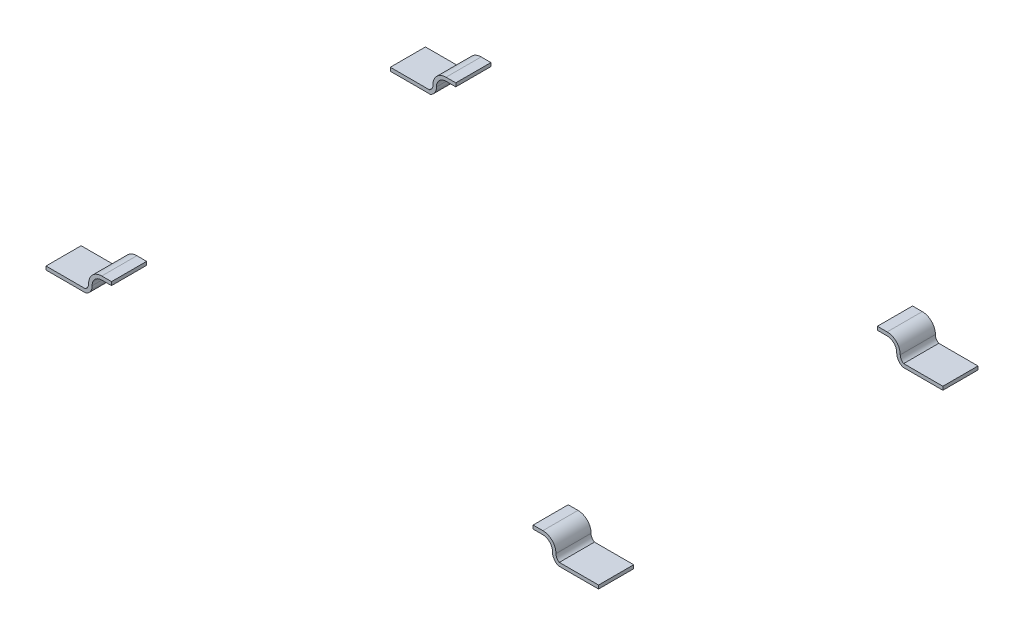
ISO-10303-21;
HEADER;
FILE_DESCRIPTION(('STEP AP214'),'2;1');
FILE_NAME('part.step','',(''),(''),'','','');
FILE_SCHEMA(('AUTOMOTIVE_DESIGN { 1 0 10303 214 1 1 1 1 }'));
ENDSEC;
DATA;
#1=APPLICATION_CONTEXT('core data for automotive mechanical design processes');
#2=APPLICATION_PROTOCOL_DEFINITION('international standard','automotive_design',2000,#1);
#3=PRODUCT_CONTEXT('',#1,'mechanical');
#4=PRODUCT('Part','Part','',(#3));
#5=PRODUCT_RELATED_PRODUCT_CATEGORY('part','',(#4));
#6=PRODUCT_DEFINITION_FORMATION('','',#4);
#7=PRODUCT_DEFINITION_CONTEXT('part definition',#1,'design');
#8=PRODUCT_DEFINITION('design','',#6,#7);
#9=PRODUCT_DEFINITION_SHAPE('','',#8);
#10=(LENGTH_UNIT() NAMED_UNIT(*) SI_UNIT(.MILLI.,.METRE.));
#11=(NAMED_UNIT(*) PLANE_ANGLE_UNIT() SI_UNIT($,.RADIAN.));
#12=(NAMED_UNIT(*) SI_UNIT($,.STERADIAN.) SOLID_ANGLE_UNIT());
#13=UNCERTAINTY_MEASURE_WITH_UNIT(LENGTH_MEASURE(1.E-05),#10,'distance_accuracy_value','');
#14=(GEOMETRIC_REPRESENTATION_CONTEXT(3) GLOBAL_UNCERTAINTY_ASSIGNED_CONTEXT((#13)) GLOBAL_UNIT_ASSIGNED_CONTEXT((#10,
#11,#12)) REPRESENTATION_CONTEXT('',''));
#15=CARTESIAN_POINT('',(0.,0.,0.));
#16=DIRECTION('',(0.,0.,1.));
#17=DIRECTION('',(1.,0.,0.));
#18=AXIS2_PLACEMENT_3D('',#15,#16,#17);
#19=CARTESIAN_POINT('',(-0.941850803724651,0.0497758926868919,0.));
#20=DIRECTION('',(0.,1.,0.));
#21=DIRECTION('',(-1.,0.,0.));
#22=AXIS2_PLACEMENT_3D('',#19,#20,#21);
#23=PLANE('',#22);
#24=DIRECTION('',(1.,0.,0.));
#25=VECTOR('',#24,1.);
#26=CARTESIAN_POINT('',(-0.46748291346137,0.0497758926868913,-0.5));
#27=LINE('',#26,#25);
#28=CARTESIAN_POINT('',(-0.383700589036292,0.0497758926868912,-0.5));
#29=VERTEX_POINT('',#28);
#30=CARTESIAN_POINT('',(-0.941850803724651,0.0497758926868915,-0.5));
#31=VERTEX_POINT('',#30);
#32=EDGE_CURVE('P0_E121',#29,#31,#27,.F.);
#33=ORIENTED_EDGE('',*,*,#32,.T.);
#34=DIRECTION('',(0.,0.,1.));
#35=VECTOR('',#34,1.);
#36=CARTESIAN_POINT('',(-0.941850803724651,0.0497758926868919,0.));
#37=LINE('',#36,#35);
#38=CARTESIAN_POINT('',(-0.941850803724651,0.0497758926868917,0.));
#39=VERTEX_POINT('',#38);
#40=EDGE_CURVE('P0_E100',#39,#31,#37,.F.);
#41=ORIENTED_EDGE('',*,*,#40,.F.);
#42=DIRECTION('',(1.,0.,0.));
#43=VECTOR('',#42,1.);
#44=CARTESIAN_POINT('',(-0.46748291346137,0.0497758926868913,0.));
#45=LINE('',#44,#43);
#46=CARTESIAN_POINT('',(-0.383700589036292,0.0497758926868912,0.));
#47=VERTEX_POINT('',#46);
#48=EDGE_CURVE('P0_E98',#47,#39,#45,.F.);
#49=ORIENTED_EDGE('',*,*,#48,.F.);
#50=DIRECTION('',(0.,0.,-1.));
#51=VECTOR('',#50,1.);
#52=CARTESIAN_POINT('',(-0.383700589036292,0.049775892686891,0.));
#53=LINE('',#52,#51);
#54=EDGE_CURVE('P0_E84',#47,#29,#53,.T.);
#55=ORIENTED_EDGE('',*,*,#54,.T.);
#56=EDGE_LOOP('',(#33,#41,#49,#55));
#57=FACE_BOUND('',#56,.T.);
#58=ADVANCED_FACE('P0_F16',(#57),#23,.T.);
#59=CARTESIAN_POINT('',(-0.0100000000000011,0.273237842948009,0.));
#60=DIRECTION('',(0.,-1.,0.));
#61=DIRECTION('',(0.,0.,-1.));
#62=AXIS2_PLACEMENT_3D('',#59,#60,#61);
#63=PLANE('',#62);
#64=DIRECTION('',(1.,0.,0.));
#65=VECTOR('',#64,1.);
#66=CARTESIAN_POINT('',(-0.46748291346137,0.273237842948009,-0.5));
#67=LINE('',#66,#65);
#68=CARTESIAN_POINT('',(-0.148885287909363,0.273237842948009,-0.5));
#69=VERTEX_POINT('',#68);
#70=CARTESIAN_POINT('',(-0.0100000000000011,0.273237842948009,-0.5));
#71=VERTEX_POINT('',#70);
#72=EDGE_CURVE('P0_E143',#69,#71,#67,.T.);
#73=ORIENTED_EDGE('',*,*,#72,.T.);
#74=DIRECTION('',(0.,0.,-1.));
#75=VECTOR('',#74,1.);
#76=CARTESIAN_POINT('',(-0.0100000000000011,0.273237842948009,0.));
#77=LINE('',#76,#75);
#78=CARTESIAN_POINT('',(-0.0100000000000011,0.273237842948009,0.));
#79=VERTEX_POINT('',#78);
#80=EDGE_CURVE('P0_E194',#79,#71,#77,.T.);
#81=ORIENTED_EDGE('',*,*,#80,.F.);
#82=DIRECTION('',(1.,0.,0.));
#83=VECTOR('',#82,1.);
#84=CARTESIAN_POINT('',(-0.46748291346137,0.273237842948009,0.));
#85=LINE('',#84,#83);
#86=CARTESIAN_POINT('',(-0.148885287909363,0.273237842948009,0.));
#87=VERTEX_POINT('',#86);
#88=EDGE_CURVE('P0_E129',#87,#79,#85,.T.);
#89=ORIENTED_EDGE('',*,*,#88,.F.);
#90=DIRECTION('',(0.,0.,-1.));
#91=VECTOR('',#90,1.);
#92=CARTESIAN_POINT('',(-0.148885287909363,0.273237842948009,0.));
#93=LINE('',#92,#91);
#94=EDGE_CURVE('P0_E109',#87,#69,#93,.T.);
#95=ORIENTED_EDGE('',*,*,#94,.T.);
#96=EDGE_LOOP('',(#73,#81,#89,#95));
#97=FACE_BOUND('',#96,.T.);
#98=ADVANCED_FACE('P0_F230',(#97),#63,.T.);
#99=CARTESIAN_POINT('',(-0.0100000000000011,0.323237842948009,0.));
#100=DIRECTION('',(1.,0.,0.));
#101=DIRECTION('',(0.,0.,-1.));
#102=AXIS2_PLACEMENT_3D('',#99,#100,#101);
#103=PLANE('',#102);
#104=DIRECTION('',(0.,1.,0.));
#105=VECTOR('',#104,1.);
#106=CARTESIAN_POINT('',(-0.0100000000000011,0.111450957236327,-0.5));
#107=LINE('',#106,#105);
#108=CARTESIAN_POINT('',(-0.0100000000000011,0.323237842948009,-0.5));
#109=VERTEX_POINT('',#108);
#110=EDGE_CURVE('P0_E158',#71,#109,#107,.T.);
#111=ORIENTED_EDGE('',*,*,#110,.T.);
#112=DIRECTION('',(0.,0.,1.));
#113=VECTOR('',#112,1.);
#114=CARTESIAN_POINT('',(-0.0100000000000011,0.323237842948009,0.));
#115=LINE('',#114,#113);
#116=CARTESIAN_POINT('',(-0.0100000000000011,0.323237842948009,0.));
#117=VERTEX_POINT('',#116);
#118=EDGE_CURVE('P0_E191',#117,#109,#115,.F.);
#119=ORIENTED_EDGE('',*,*,#118,.F.);
#120=DIRECTION('',(0.,1.,0.));
#121=VECTOR('',#120,1.);
#122=CARTESIAN_POINT('',(-0.0100000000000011,0.111450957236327,0.));
#123=LINE('',#122,#121);
#124=EDGE_CURVE('P0_E125',#79,#117,#123,.T.);
#125=ORIENTED_EDGE('',*,*,#124,.F.);
#126=ORIENTED_EDGE('',*,*,#80,.T.);
#127=EDGE_LOOP('',(#111,#119,#125,#126));
#128=FACE_BOUND('',#127,.T.);
#129=ADVANCED_FACE('P0_F205',(#128),#103,.T.);
#130=CARTESIAN_POINT('',(-0.148885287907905,0.323237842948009,0.));
#131=DIRECTION('',(0.,1.,0.));
#132=DIRECTION('',(-1.,0.,0.));
#133=AXIS2_PLACEMENT_3D('',#130,#131,#132);
#134=PLANE('',#133);
#135=DIRECTION('',(1.,0.,0.));
#136=VECTOR('',#135,1.);
#137=CARTESIAN_POINT('',(-0.46748291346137,0.323237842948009,-0.5));
#138=LINE('',#137,#136);
#139=CARTESIAN_POINT('',(-0.148885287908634,0.323237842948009,-0.5));
#140=VERTEX_POINT('',#139);
#141=EDGE_CURVE('P0_E140',#109,#140,#138,.F.);
#142=ORIENTED_EDGE('',*,*,#141,.T.);
#143=DIRECTION('',(0.,0.,-1.));
#144=VECTOR('',#143,1.);
#145=CARTESIAN_POINT('',(-0.148885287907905,0.323237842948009,0.));
#146=LINE('',#145,#144);
#147=CARTESIAN_POINT('',(-0.148885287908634,0.323237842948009,0.));
#148=VERTEX_POINT('',#147);
#149=EDGE_CURVE('P0_E94',#148,#140,#146,.T.);
#150=ORIENTED_EDGE('',*,*,#149,.F.);
#151=DIRECTION('',(1.,0.,0.));
#152=VECTOR('',#151,1.);
#153=CARTESIAN_POINT('',(-0.46748291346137,0.323237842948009,0.));
#154=LINE('',#153,#152);
#155=EDGE_CURVE('P0_E128',#117,#148,#154,.F.);
#156=ORIENTED_EDGE('',*,*,#155,.F.);
#157=ORIENTED_EDGE('',*,*,#118,.T.);
#158=EDGE_LOOP('',(#142,#150,#156,#157));
#159=FACE_BOUND('',#158,.T.);
#160=ADVANCED_FACE('P0_F213',(#159),#134,.T.);
#161=CARTESIAN_POINT('',(-0.148885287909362,0.13687173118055,0.));
#162=DIRECTION('',(0.,0.,-1.));
#163=DIRECTION('',(-1.,0.,0.));
#164=AXIS2_PLACEMENT_3D('',#161,#162,#163);
#165=CYLINDRICAL_SURFACE('',#164,0.186366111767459);
#166=CARTESIAN_POINT('',(-0.148885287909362,0.13687173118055,-0.5));
#167=DIRECTION('',(0.,0.,-1.));
#168=DIRECTION('',(-1.,0.,0.));
#169=AXIS2_PLACEMENT_3D('',#166,#167,#168);
#170=CIRCLE('',#169,0.186366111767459);
#171=CARTESIAN_POINT('',(-0.335225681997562,0.133775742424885,-0.5));
#172=VERTEX_POINT('',#171);
#173=EDGE_CURVE('P0_E138',#140,#172,#170,.F.);
#174=ORIENTED_EDGE('',*,*,#173,.T.);
#175=DIRECTION('',(0.,0.,-1.));
#176=VECTOR('',#175,1.);
#177=CARTESIAN_POINT('',(-0.335225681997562,0.133775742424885,0.));
#178=LINE('',#177,#176);
#179=CARTESIAN_POINT('',(-0.335225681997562,0.133775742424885,0.));
#180=VERTEX_POINT('',#179);
#181=EDGE_CURVE('P0_E79',#172,#180,#178,.F.);
#182=ORIENTED_EDGE('',*,*,#181,.T.);
#183=CARTESIAN_POINT('',(-0.148885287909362,0.13687173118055,0.));
#184=DIRECTION('',(0.,0.,-1.));
#185=DIRECTION('',(-1.,0.,0.));
#186=AXIS2_PLACEMENT_3D('',#183,#184,#185);
#187=CIRCLE('',#186,0.186366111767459);
#188=EDGE_CURVE('P0_E108',#148,#180,#187,.F.);
#189=ORIENTED_EDGE('',*,*,#188,.F.);
#190=ORIENTED_EDGE('',*,*,#149,.T.);
#191=EDGE_LOOP('',(#174,#182,#189,#190));
#192=FACE_BOUND('',#191,.T.);
#193=ADVANCED_FACE('P0_F215',(#192),#165,.T.);
#194=CARTESIAN_POINT('',(-0.429527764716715,0.13220894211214,0.));
#195=DIRECTION('',(0.,0.,-1.));
#196=DIRECTION('',(-1.,0.,0.));
#197=AXIS2_PLACEMENT_3D('',#194,#195,#196);
#198=CYLINDRICAL_SURFACE('',#197,0.0943150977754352);
#199=ORIENTED_EDGE('',*,*,#181,.F.);
#200=CARTESIAN_POINT('',(-0.429527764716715,0.13220894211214,-0.5));
#201=DIRECTION('',(0.,0.,-1.));
#202=DIRECTION('',(-1.,0.,0.));
#203=AXIS2_PLACEMENT_3D('',#200,#201,#202);
#204=CIRCLE('',#203,0.0943150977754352);
#205=EDGE_CURVE('P0_E90',#172,#29,#204,.T.);
#206=ORIENTED_EDGE('',*,*,#205,.T.);
#207=ORIENTED_EDGE('',*,*,#54,.F.);
#208=CARTESIAN_POINT('',(-0.429527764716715,0.13220894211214,0.));
#209=DIRECTION('',(0.,0.,-1.));
#210=DIRECTION('',(-1.,0.,0.));
#211=AXIS2_PLACEMENT_3D('',#208,#209,#210);
#212=CIRCLE('',#211,0.0943150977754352);
#213=EDGE_CURVE('P0_E20',#180,#47,#212,.T.);
#214=ORIENTED_EDGE('',*,*,#213,.F.);
#215=EDGE_LOOP('',(#199,#206,#207,#214));
#216=FACE_BOUND('',#215,.T.);
#217=ADVANCED_FACE('P0_F86',(#216),#198,.F.);
#218=CARTESIAN_POINT('',(-0.148885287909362,0.13687173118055,0.));
#219=DIRECTION('',(0.,0.,-1.));
#220=DIRECTION('',(-1.,0.,0.));
#221=AXIS2_PLACEMENT_3D('',#218,#219,#220);
#222=CYLINDRICAL_SURFACE('',#221,0.136366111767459);
#223=DIRECTION('',(0.,0.,-1.));
#224=VECTOR('',#223,1.);
#225=CARTESIAN_POINT('',(-0.285232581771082,0.134606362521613,0.));
#226=LINE('',#225,#224);
#227=CARTESIAN_POINT('',(-0.285232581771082,0.134606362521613,-0.5));
#228=VERTEX_POINT('',#227);
#229=CARTESIAN_POINT('',(-0.285232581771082,0.134606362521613,0.));
#230=VERTEX_POINT('',#229);
#231=EDGE_CURVE('P0_E133',#228,#230,#226,.F.);
#232=ORIENTED_EDGE('',*,*,#231,.F.);
#233=CARTESIAN_POINT('',(-0.148885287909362,0.13687173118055,-0.5));
#234=DIRECTION('',(0.,0.,-1.));
#235=DIRECTION('',(-1.,0.,0.));
#236=AXIS2_PLACEMENT_3D('',#233,#234,#235);
#237=CIRCLE('',#236,0.136366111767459);
#238=EDGE_CURVE('P0_E141',#228,#69,#237,.T.);
#239=ORIENTED_EDGE('',*,*,#238,.T.);
#240=ORIENTED_EDGE('',*,*,#94,.F.);
#241=CARTESIAN_POINT('',(-0.148885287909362,0.13687173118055,0.));
#242=DIRECTION('',(0.,0.,-1.));
#243=DIRECTION('',(-1.,0.,0.));
#244=AXIS2_PLACEMENT_3D('',#241,#242,#243);
#245=CIRCLE('',#244,0.136366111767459);
#246=EDGE_CURVE('P0_E104',#230,#87,#245,.T.);
#247=ORIENTED_EDGE('',*,*,#246,.F.);
#248=EDGE_LOOP('',(#232,#239,#240,#247));
#249=FACE_BOUND('',#248,.T.);
#250=ADVANCED_FACE('P0_F229',(#249),#222,.F.);
#251=CARTESIAN_POINT('',(-0.46748291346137,0.111450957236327,0.));
#252=DIRECTION('',(0.,0.,1.));
#253=DIRECTION('',(1.,0.,0.));
#254=AXIS2_PLACEMENT_3D('',#251,#252,#253);
#255=PLANE('',#254);
#256=ORIENTED_EDGE('',*,*,#155,.T.);
#257=ORIENTED_EDGE('',*,*,#188,.T.);
#258=ORIENTED_EDGE('',*,*,#213,.T.);
#259=ORIENTED_EDGE('',*,*,#48,.T.);
#260=DIRECTION('',(0.,-1.,0.));
#261=VECTOR('',#260,1.);
#262=CARTESIAN_POINT('',(-0.94185080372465,-0.000224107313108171,0.));
#263=LINE('',#262,#261);
#264=CARTESIAN_POINT('',(-0.94185080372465,-0.00022410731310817,0.));
#265=VERTEX_POINT('',#264);
#266=EDGE_CURVE('P0_E122',#265,#39,#263,.F.);
#267=ORIENTED_EDGE('',*,*,#266,.F.);
#268=DIRECTION('',(1.,0.,0.));
#269=VECTOR('',#268,1.);
#270=CARTESIAN_POINT('',(-0.372183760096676,-0.000224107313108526,0.));
#271=LINE('',#270,#269);
#272=CARTESIAN_POINT('',(-0.372183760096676,-0.000224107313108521,0.));
#273=VERTEX_POINT('',#272);
#274=EDGE_CURVE('P0_E177',#273,#265,#271,.F.);
#275=ORIENTED_EDGE('',*,*,#274,.F.);
#276=CARTESIAN_POINT('',(-0.429527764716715,0.13220894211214,0.));
#277=DIRECTION('',(0.,0.,-1.));
#278=DIRECTION('',(-1.,0.,0.));
#279=AXIS2_PLACEMENT_3D('',#276,#277,#278);
#280=CIRCLE('',#279,0.144315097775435);
#281=EDGE_CURVE('P0_E134',#230,#273,#280,.T.);
#282=ORIENTED_EDGE('',*,*,#281,.F.);
#283=ORIENTED_EDGE('',*,*,#246,.T.);
#284=ORIENTED_EDGE('',*,*,#88,.T.);
#285=ORIENTED_EDGE('',*,*,#124,.T.);
#286=EDGE_LOOP('',(#256,#257,#258,#259,#267,#275,#282,#283,#284,#285));
#287=FACE_BOUND('',#286,.T.);
#288=ADVANCED_FACE('P0_F107',(#287),#255,.T.);
#289=CARTESIAN_POINT('',(-0.94185080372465,-0.000224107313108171,0.));
#290=DIRECTION('',(-1.,0.,0.));
#291=DIRECTION('',(0.,-1.,0.));
#292=AXIS2_PLACEMENT_3D('',#289,#290,#291);
#293=PLANE('',#292);
#294=DIRECTION('',(0.,1.,0.));
#295=VECTOR('',#294,1.);
#296=CARTESIAN_POINT('',(-0.941850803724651,0.111450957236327,-0.5));
#297=LINE('',#296,#295);
#298=CARTESIAN_POINT('',(-0.941850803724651,-0.00022410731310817,-0.5));
#299=VERTEX_POINT('',#298);
#300=EDGE_CURVE('P0_E144',#31,#299,#297,.F.);
#301=ORIENTED_EDGE('',*,*,#300,.T.);
#302=DIRECTION('',(0.,0.,1.));
#303=VECTOR('',#302,1.);
#304=CARTESIAN_POINT('',(-0.94185080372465,-0.00022410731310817,0.));
#305=LINE('',#304,#303);
#306=EDGE_CURVE('P0_E169',#265,#299,#305,.F.);
#307=ORIENTED_EDGE('',*,*,#306,.F.);
#308=ORIENTED_EDGE('',*,*,#266,.T.);
#309=ORIENTED_EDGE('',*,*,#40,.T.);
#310=EDGE_LOOP('',(#301,#307,#308,#309));
#311=FACE_BOUND('',#310,.T.);
#312=ADVANCED_FACE('P0_F222',(#311),#293,.T.);
#313=CARTESIAN_POINT('',(-0.46748291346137,0.111450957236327,-0.5));
#314=DIRECTION('',(0.,0.,1.));
#315=DIRECTION('',(1.,0.,0.));
#316=AXIS2_PLACEMENT_3D('',#313,#314,#315);
#317=PLANE('',#316);
#318=ORIENTED_EDGE('',*,*,#173,.F.);
#319=ORIENTED_EDGE('',*,*,#141,.F.);
#320=ORIENTED_EDGE('',*,*,#110,.F.);
#321=ORIENTED_EDGE('',*,*,#72,.F.);
#322=ORIENTED_EDGE('',*,*,#238,.F.);
#323=CARTESIAN_POINT('',(-0.429527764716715,0.13220894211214,-0.5));
#324=DIRECTION('',(0.,0.,-1.));
#325=DIRECTION('',(-1.,0.,0.));
#326=AXIS2_PLACEMENT_3D('',#323,#324,#325);
#327=CIRCLE('',#326,0.144315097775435);
#328=CARTESIAN_POINT('',(-0.372183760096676,-0.000224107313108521,-0.5));
#329=VERTEX_POINT('',#328);
#330=EDGE_CURVE('P0_E35',#329,#228,#327,.F.);
#331=ORIENTED_EDGE('',*,*,#330,.F.);
#332=DIRECTION('',(1.,0.,0.));
#333=VECTOR('',#332,1.);
#334=CARTESIAN_POINT('',(-0.372183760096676,-0.000224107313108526,-0.5));
#335=LINE('',#334,#333);
#336=EDGE_CURVE('P0_E26',#299,#329,#335,.T.);
#337=ORIENTED_EDGE('',*,*,#336,.F.);
#338=ORIENTED_EDGE('',*,*,#300,.F.);
#339=ORIENTED_EDGE('',*,*,#32,.F.);
#340=ORIENTED_EDGE('',*,*,#205,.F.);
#341=EDGE_LOOP('',(#318,#319,#320,#321,#322,#331,#337,#338,#339,#340));
#342=FACE_BOUND('',#341,.T.);
#343=ADVANCED_FACE('P0_F210',(#342),#317,.F.);
#344=CARTESIAN_POINT('',(-0.429527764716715,0.13220894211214,0.));
#345=DIRECTION('',(0.,0.,-1.));
#346=DIRECTION('',(-1.,0.,0.));
#347=AXIS2_PLACEMENT_3D('',#344,#345,#346);
#348=CYLINDRICAL_SURFACE('',#347,0.144315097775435);
#349=ORIENTED_EDGE('',*,*,#330,.T.);
#350=ORIENTED_EDGE('',*,*,#231,.T.);
#351=ORIENTED_EDGE('',*,*,#281,.T.);
#352=DIRECTION('',(0.,0.,1.));
#353=VECTOR('',#352,1.);
#354=CARTESIAN_POINT('',(-0.372183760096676,-0.000224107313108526,0.));
#355=LINE('',#354,#353);
#356=EDGE_CURVE('P0_E11',#329,#273,#355,.T.);
#357=ORIENTED_EDGE('',*,*,#356,.F.);
#358=EDGE_LOOP('',(#349,#350,#351,#357));
#359=FACE_BOUND('',#358,.T.);
#360=ADVANCED_FACE('P0_F226',(#359),#348,.T.);
#361=CARTESIAN_POINT('',(-0.372183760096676,-0.000224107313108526,0.));
#362=DIRECTION('',(0.,-1.,0.));
#363=DIRECTION('',(1.,0.,0.));
#364=AXIS2_PLACEMENT_3D('',#361,#362,#363);
#365=PLANE('',#364);
#366=ORIENTED_EDGE('',*,*,#336,.T.);
#367=ORIENTED_EDGE('',*,*,#356,.T.);
#368=ORIENTED_EDGE('',*,*,#274,.T.);
#369=ORIENTED_EDGE('',*,*,#306,.T.);
#370=EDGE_LOOP('',(#366,#367,#368,#369));
#371=FACE_BOUND('',#370,.T.);
#372=ADVANCED_FACE('P0_F18',(#371),#365,.T.);
#373=CLOSED_SHELL('',(#58,#98,#129,#160,#193,#217,#250,#288,#312,#343,#360,#372));
#374=MANIFOLD_SOLID_BREP('P0_B1',#373);
#375=CARTESIAN_POINT('',(6.12888528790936,0.273237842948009,0.));
#376=DIRECTION('',(0.,-1.,0.));
#377=DIRECTION('',(0.,0.,-1.));
#378=AXIS2_PLACEMENT_3D('',#375,#376,#377);
#379=PLANE('',#378);
#380=DIRECTION('',(1.,0.,0.));
#381=VECTOR('',#380,1.);
#382=CARTESIAN_POINT('',(6.44748291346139,0.273237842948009,-0.5));
#383=LINE('',#382,#381);
#384=CARTESIAN_POINT('',(5.99,0.273237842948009,-0.5));
#385=VERTEX_POINT('',#384);
#386=CARTESIAN_POINT('',(6.12888528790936,0.273237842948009,-0.5));
#387=VERTEX_POINT('',#386);
#388=EDGE_CURVE('P1_E97',#385,#387,#383,.T.);
#389=ORIENTED_EDGE('',*,*,#388,.T.);
#390=DIRECTION('',(0.,0.,-1.));
#391=VECTOR('',#390,1.);
#392=CARTESIAN_POINT('',(6.12888528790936,0.273237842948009,0.));
#393=LINE('',#392,#391);
#394=CARTESIAN_POINT('',(6.12888528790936,0.273237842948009,0.));
#395=VERTEX_POINT('',#394);
#396=EDGE_CURVE('P1_E91',#387,#395,#393,.F.);
#397=ORIENTED_EDGE('',*,*,#396,.T.);
#398=DIRECTION('',(1.,0.,0.));
#399=VECTOR('',#398,1.);
#400=CARTESIAN_POINT('',(6.44748291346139,0.273237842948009,0.));
#401=LINE('',#400,#399);
#402=CARTESIAN_POINT('',(5.99,0.273237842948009,0.));
#403=VERTEX_POINT('',#402);
#404=EDGE_CURVE('P1_E94',#403,#395,#401,.T.);
#405=ORIENTED_EDGE('',*,*,#404,.F.);
#406=DIRECTION('',(0.,0.,1.));
#407=VECTOR('',#406,1.);
#408=CARTESIAN_POINT('',(5.99,0.273237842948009,0.));
#409=LINE('',#408,#407);
#410=EDGE_CURVE('P1_E174',#385,#403,#409,.T.);
#411=ORIENTED_EDGE('',*,*,#410,.F.);
#412=EDGE_LOOP('',(#389,#397,#405,#411));
#413=FACE_BOUND('',#412,.T.);
#414=ADVANCED_FACE('P1_F16',(#413),#379,.T.);
#415=CARTESIAN_POINT('',(6.12888528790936,0.136871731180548,0.));
#416=DIRECTION('',(0.,0.,-1.));
#417=DIRECTION('',(-1.,0.,0.));
#418=AXIS2_PLACEMENT_3D('',#415,#416,#417);
#419=CYLINDRICAL_SURFACE('',#418,0.136366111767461);
#420=ORIENTED_EDGE('',*,*,#396,.F.);
#421=CARTESIAN_POINT('',(6.12888528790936,0.136871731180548,-0.5));
#422=DIRECTION('',(0.,0.,-1.));
#423=DIRECTION('',(-1.,0.,0.));
#424=AXIS2_PLACEMENT_3D('',#421,#422,#423);
#425=CIRCLE('',#424,0.136366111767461);
#426=CARTESIAN_POINT('',(6.26523258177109,0.134606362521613,-0.5));
#427=VERTEX_POINT('',#426);
#428=EDGE_CURVE('P1_E138',#387,#427,#425,.T.);
#429=ORIENTED_EDGE('',*,*,#428,.T.);
#430=DIRECTION('',(0.,0.,-1.));
#431=VECTOR('',#430,1.);
#432=CARTESIAN_POINT('',(6.26523258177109,0.134606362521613,0.));
#433=LINE('',#432,#431);
#434=CARTESIAN_POINT('',(6.26523258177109,0.134606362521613,0.));
#435=VERTEX_POINT('',#434);
#436=EDGE_CURVE('P1_E106',#435,#427,#433,.T.);
#437=ORIENTED_EDGE('',*,*,#436,.F.);
#438=CARTESIAN_POINT('',(6.12888528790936,0.136871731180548,0.));
#439=DIRECTION('',(0.,0.,-1.));
#440=DIRECTION('',(-1.,0.,0.));
#441=AXIS2_PLACEMENT_3D('',#438,#439,#440);
#442=CIRCLE('',#441,0.136366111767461);
#443=EDGE_CURVE('P1_E20',#395,#435,#442,.T.);
#444=ORIENTED_EDGE('',*,*,#443,.F.);
#445=EDGE_LOOP('',(#420,#429,#437,#444));
#446=FACE_BOUND('',#445,.T.);
#447=ADVANCED_FACE('P1_F104',(#446),#419,.F.);
#448=CARTESIAN_POINT('',(6.40952776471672,0.132208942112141,0.));
#449=DIRECTION('',(0.,0.,-1.));
#450=DIRECTION('',(-1.,0.,0.));
#451=AXIS2_PLACEMENT_3D('',#448,#449,#450);
#452=CYLINDRICAL_SURFACE('',#451,0.0943150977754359);
#453=DIRECTION('',(0.,0.,1.));
#454=VECTOR('',#453,1.);
#455=CARTESIAN_POINT('',(6.36370058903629,0.0497758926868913,0.));
#456=LINE('',#455,#454);
#457=CARTESIAN_POINT('',(6.36370058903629,0.0497758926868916,-0.5));
#458=VERTEX_POINT('',#457);
#459=CARTESIAN_POINT('',(6.36370058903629,0.0497758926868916,0.));
#460=VERTEX_POINT('',#459);
#461=EDGE_CURVE('P1_E116',#458,#460,#456,.T.);
#462=ORIENTED_EDGE('',*,*,#461,.F.);
#463=CARTESIAN_POINT('',(6.40952776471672,0.132208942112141,-0.5));
#464=DIRECTION('',(0.,0.,-1.));
#465=DIRECTION('',(-1.,0.,0.));
#466=AXIS2_PLACEMENT_3D('',#463,#464,#465);
#467=CIRCLE('',#466,0.0943150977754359);
#468=CARTESIAN_POINT('',(6.31522568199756,0.13377574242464,-0.5));
#469=VERTEX_POINT('',#468);
#470=EDGE_CURVE('P1_E133',#458,#469,#467,.T.);
#471=ORIENTED_EDGE('',*,*,#470,.T.);
#472=DIRECTION('',(0.,0.,-1.));
#473=VECTOR('',#472,1.);
#474=CARTESIAN_POINT('',(6.31522568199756,0.133775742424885,0.));
#475=LINE('',#474,#473);
#476=CARTESIAN_POINT('',(6.31522568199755,0.13377574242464,0.));
#477=VERTEX_POINT('',#476);
#478=EDGE_CURVE('P1_E100',#477,#469,#475,.T.);
#479=ORIENTED_EDGE('',*,*,#478,.F.);
#480=CARTESIAN_POINT('',(6.40952776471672,0.132208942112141,0.));
#481=DIRECTION('',(0.,0.,-1.));
#482=DIRECTION('',(-1.,0.,0.));
#483=AXIS2_PLACEMENT_3D('',#480,#481,#482);
#484=CIRCLE('',#483,0.0943150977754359);
#485=EDGE_CURVE('P1_E198',#460,#477,#484,.T.);
#486=ORIENTED_EDGE('',*,*,#485,.F.);
#487=EDGE_LOOP('',(#462,#471,#479,#486));
#488=FACE_BOUND('',#487,.T.);
#489=ADVANCED_FACE('P1_F248',(#488),#452,.F.);
#490=CARTESIAN_POINT('',(6.1288852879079,0.136871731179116,0.));
#491=DIRECTION('',(0.,0.,-1.));
#492=DIRECTION('',(-1.,0.,0.));
#493=AXIS2_PLACEMENT_3D('',#490,#491,#492);
#494=CYLINDRICAL_SURFACE('',#493,0.186366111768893);
#495=CARTESIAN_POINT('',(6.1288852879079,0.136871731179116,-0.5));
#496=DIRECTION('',(0.,0.,-1.));
#497=DIRECTION('',(-1.,0.,0.));
#498=AXIS2_PLACEMENT_3D('',#495,#496,#497);
#499=CIRCLE('',#498,0.186366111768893);
#500=CARTESIAN_POINT('',(6.1288852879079,0.323237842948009,-0.5));
#501=VERTEX_POINT('',#500);
#502=EDGE_CURVE('P1_E127',#469,#501,#499,.F.);
#503=ORIENTED_EDGE('',*,*,#502,.T.);
#504=DIRECTION('',(0.,0.,1.));
#505=VECTOR('',#504,1.);
#506=CARTESIAN_POINT('',(6.12888528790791,0.323237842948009,0.));
#507=LINE('',#506,#505);
#508=CARTESIAN_POINT('',(6.1288852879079,0.323237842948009,0.));
#509=VERTEX_POINT('',#508);
#510=EDGE_CURVE('P1_E168',#509,#501,#507,.F.);
#511=ORIENTED_EDGE('',*,*,#510,.F.);
#512=CARTESIAN_POINT('',(6.1288852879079,0.136871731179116,0.));
#513=DIRECTION('',(0.,0.,-1.));
#514=DIRECTION('',(-1.,0.,0.));
#515=AXIS2_PLACEMENT_3D('',#512,#513,#514);
#516=CIRCLE('',#515,0.186366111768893);
#517=EDGE_CURVE('P1_E197',#477,#509,#516,.F.);
#518=ORIENTED_EDGE('',*,*,#517,.F.);
#519=ORIENTED_EDGE('',*,*,#478,.T.);
#520=EDGE_LOOP('',(#503,#511,#518,#519));
#521=FACE_BOUND('',#520,.T.);
#522=ADVANCED_FACE('P1_F245',(#521),#494,.T.);
#523=CARTESIAN_POINT('',(5.99,0.323237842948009,0.));
#524=DIRECTION('',(0.,1.,0.));
#525=DIRECTION('',(0.,0.,1.));
#526=AXIS2_PLACEMENT_3D('',#523,#524,#525);
#527=PLANE('',#526);
#528=DIRECTION('',(1.,0.,0.));
#529=VECTOR('',#528,1.);
#530=CARTESIAN_POINT('',(6.44748291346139,0.323237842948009,-0.5));
#531=LINE('',#530,#529);
#532=CARTESIAN_POINT('',(5.99,0.323237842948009,-0.5));
#533=VERTEX_POINT('',#532);
#534=EDGE_CURVE('P1_E124',#501,#533,#531,.F.);
#535=ORIENTED_EDGE('',*,*,#534,.T.);
#536=DIRECTION('',(0.,0.,1.));
#537=VECTOR('',#536,1.);
#538=CARTESIAN_POINT('',(5.99,0.323237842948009,0.));
#539=LINE('',#538,#537);
#540=CARTESIAN_POINT('',(5.99,0.323237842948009,0.));
#541=VERTEX_POINT('',#540);
#542=EDGE_CURVE('P1_E171',#541,#533,#539,.F.);
#543=ORIENTED_EDGE('',*,*,#542,.F.);
#544=DIRECTION('',(1.,0.,0.));
#545=VECTOR('',#544,1.);
#546=CARTESIAN_POINT('',(6.44748291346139,0.323237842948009,0.));
#547=LINE('',#546,#545);
#548=EDGE_CURVE('P1_E196',#509,#541,#547,.F.);
#549=ORIENTED_EDGE('',*,*,#548,.F.);
#550=ORIENTED_EDGE('',*,*,#510,.T.);
#551=EDGE_LOOP('',(#535,#543,#549,#550));
#552=FACE_BOUND('',#551,.T.);
#553=ADVANCED_FACE('P1_F209',(#552),#527,.T.);
#554=CARTESIAN_POINT('',(5.99,0.273237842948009,0.));
#555=DIRECTION('',(-1.,0.,0.));
#556=DIRECTION('',(0.,0.,1.));
#557=AXIS2_PLACEMENT_3D('',#554,#555,#556);
#558=PLANE('',#557);
#559=DIRECTION('',(0.,1.,0.));
#560=VECTOR('',#559,1.);
#561=CARTESIAN_POINT('',(5.99,0.111450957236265,-0.5));
#562=LINE('',#561,#560);
#563=EDGE_CURVE('P1_E126',#533,#385,#562,.F.);
#564=ORIENTED_EDGE('',*,*,#563,.T.);
#565=ORIENTED_EDGE('',*,*,#410,.T.);
#566=DIRECTION('',(0.,1.,0.));
#567=VECTOR('',#566,1.);
#568=CARTESIAN_POINT('',(5.99,0.111450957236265,0.));
#569=LINE('',#568,#567);
#570=EDGE_CURVE('P1_E114',#541,#403,#569,.F.);
#571=ORIENTED_EDGE('',*,*,#570,.F.);
#572=ORIENTED_EDGE('',*,*,#542,.T.);
#573=EDGE_LOOP('',(#564,#565,#571,#572));
#574=FACE_BOUND('',#573,.T.);
#575=ADVANCED_FACE('P1_F213',(#574),#558,.T.);
#576=CARTESIAN_POINT('',(6.36370058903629,0.0497758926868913,0.));
#577=DIRECTION('',(0.,1.,0.));
#578=DIRECTION('',(-1.,0.,0.));
#579=AXIS2_PLACEMENT_3D('',#576,#577,#578);
#580=PLANE('',#579);
#581=DIRECTION('',(1.,0.,0.));
#582=VECTOR('',#581,1.);
#583=CARTESIAN_POINT('',(6.44748291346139,0.0497758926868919,-0.5));
#584=LINE('',#583,#582);
#585=CARTESIAN_POINT('',(6.92185080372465,0.0497758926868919,-0.5));
#586=VERTEX_POINT('',#585);
#587=EDGE_CURVE('P1_E130',#586,#458,#584,.F.);
#588=ORIENTED_EDGE('',*,*,#587,.T.);
#589=ORIENTED_EDGE('',*,*,#461,.T.);
#590=DIRECTION('',(1.,0.,0.));
#591=VECTOR('',#590,1.);
#592=CARTESIAN_POINT('',(6.44748291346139,0.0497758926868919,0.));
#593=LINE('',#592,#591);
#594=CARTESIAN_POINT('',(6.92185080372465,0.0497758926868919,0.));
#595=VERTEX_POINT('',#594);
#596=EDGE_CURVE('P1_E109',#595,#460,#593,.F.);
#597=ORIENTED_EDGE('',*,*,#596,.F.);
#598=DIRECTION('',(0.,0.,-1.));
#599=VECTOR('',#598,1.);
#600=CARTESIAN_POINT('',(6.92185080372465,0.0497758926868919,0.));
#601=LINE('',#600,#599);
#602=EDGE_CURVE('P1_E152',#586,#595,#601,.F.);
#603=ORIENTED_EDGE('',*,*,#602,.F.);
#604=EDGE_LOOP('',(#588,#589,#597,#603));
#605=FACE_BOUND('',#604,.T.);
#606=ADVANCED_FACE('P1_F237',(#605),#580,.T.);
#607=CARTESIAN_POINT('',(6.44748291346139,0.111450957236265,0.));
#608=DIRECTION('',(0.,0.,1.));
#609=DIRECTION('',(1.,0.,0.));
#610=AXIS2_PLACEMENT_3D('',#607,#608,#609);
#611=PLANE('',#610);
#612=ORIENTED_EDGE('',*,*,#517,.T.);
#613=ORIENTED_EDGE('',*,*,#548,.T.);
#614=ORIENTED_EDGE('',*,*,#570,.T.);
#615=ORIENTED_EDGE('',*,*,#404,.T.);
#616=ORIENTED_EDGE('',*,*,#443,.T.);
#617=CARTESIAN_POINT('',(6.40952776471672,0.13220894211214,0.));
#618=DIRECTION('',(0.,0.,-1.));
#619=DIRECTION('',(-1.,0.,0.));
#620=AXIS2_PLACEMENT_3D('',#617,#618,#619);
#621=CIRCLE('',#620,0.144315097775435);
#622=CARTESIAN_POINT('',(6.35218376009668,-0.000224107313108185,0.));
#623=VERTEX_POINT('',#622);
#624=EDGE_CURVE('P1_E184',#623,#435,#621,.T.);
#625=ORIENTED_EDGE('',*,*,#624,.F.);
#626=DIRECTION('',(1.,0.,0.));
#627=VECTOR('',#626,1.);
#628=CARTESIAN_POINT('',(6.92185080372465,-0.000224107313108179,0.));
#629=LINE('',#628,#627);
#630=CARTESIAN_POINT('',(6.92185080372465,-0.000224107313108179,0.));
#631=VERTEX_POINT('',#630);
#632=EDGE_CURVE('P1_E144',#631,#623,#629,.F.);
#633=ORIENTED_EDGE('',*,*,#632,.F.);
#634=DIRECTION('',(0.,1.,0.));
#635=VECTOR('',#634,1.);
#636=CARTESIAN_POINT('',(6.92185080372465,0.0497758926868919,0.));
#637=LINE('',#636,#635);
#638=EDGE_CURVE('P1_E153',#595,#631,#637,.F.);
#639=ORIENTED_EDGE('',*,*,#638,.F.);
#640=ORIENTED_EDGE('',*,*,#596,.T.);
#641=ORIENTED_EDGE('',*,*,#485,.T.);
#642=EDGE_LOOP('',(#612,#613,#614,#615,#616,#625,#633,#639,#640,#641));
#643=FACE_BOUND('',#642,.T.);
#644=ADVANCED_FACE('P1_F111',(#643),#611,.T.);
#645=CARTESIAN_POINT('',(6.40952776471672,0.13220894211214,0.));
#646=DIRECTION('',(0.,0.,-1.));
#647=DIRECTION('',(-1.,0.,0.));
#648=AXIS2_PLACEMENT_3D('',#645,#646,#647);
#649=CYLINDRICAL_SURFACE('',#648,0.144315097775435);
#650=CARTESIAN_POINT('',(6.40952776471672,0.13220894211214,-0.5));
#651=DIRECTION('',(0.,0.,-1.));
#652=DIRECTION('',(-1.,0.,0.));
#653=AXIS2_PLACEMENT_3D('',#650,#651,#652);
#654=CIRCLE('',#653,0.144315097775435);
#655=CARTESIAN_POINT('',(6.35218376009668,-0.000224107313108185,-0.5));
#656=VERTEX_POINT('',#655);
#657=EDGE_CURVE('P1_E134',#427,#656,#654,.F.);
#658=ORIENTED_EDGE('',*,*,#657,.T.);
#659=DIRECTION('',(0.,0.,-1.));
#660=VECTOR('',#659,1.);
#661=CARTESIAN_POINT('',(6.35218376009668,-0.000224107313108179,0.));
#662=LINE('',#661,#660);
#663=EDGE_CURVE('P1_E141',#623,#656,#662,.T.);
#664=ORIENTED_EDGE('',*,*,#663,.F.);
#665=ORIENTED_EDGE('',*,*,#624,.T.);
#666=ORIENTED_EDGE('',*,*,#436,.T.);
#667=EDGE_LOOP('',(#658,#664,#665,#666));
#668=FACE_BOUND('',#667,.T.);
#669=ADVANCED_FACE('P1_F217',(#668),#649,.T.);
#670=CARTESIAN_POINT('',(6.44748291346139,0.111450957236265,-0.5));
#671=DIRECTION('',(0.,0.,1.));
#672=DIRECTION('',(1.,0.,0.));
#673=AXIS2_PLACEMENT_3D('',#670,#671,#672);
#674=PLANE('',#673);
#675=ORIENTED_EDGE('',*,*,#534,.F.);
#676=ORIENTED_EDGE('',*,*,#502,.F.);
#677=ORIENTED_EDGE('',*,*,#470,.F.);
#678=ORIENTED_EDGE('',*,*,#587,.F.);
#679=DIRECTION('',(0.,1.,0.));
#680=VECTOR('',#679,1.);
#681=CARTESIAN_POINT('',(6.92185080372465,0.0497758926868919,-0.5));
#682=LINE('',#681,#680);
#683=CARTESIAN_POINT('',(6.92185080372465,-0.000224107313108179,-0.5));
#684=VERTEX_POINT('',#683);
#685=EDGE_CURVE('P1_E35',#684,#586,#682,.T.);
#686=ORIENTED_EDGE('',*,*,#685,.F.);
#687=DIRECTION('',(1.,0.,0.));
#688=VECTOR('',#687,1.);
#689=CARTESIAN_POINT('',(6.92185080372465,-0.000224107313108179,-0.5));
#690=LINE('',#689,#688);
#691=EDGE_CURVE('P1_E26',#656,#684,#690,.T.);
#692=ORIENTED_EDGE('',*,*,#691,.F.);
#693=ORIENTED_EDGE('',*,*,#657,.F.);
#694=ORIENTED_EDGE('',*,*,#428,.F.);
#695=ORIENTED_EDGE('',*,*,#388,.F.);
#696=ORIENTED_EDGE('',*,*,#563,.F.);
#697=EDGE_LOOP('',(#675,#676,#677,#678,#686,#692,#693,#694,#695,#696));
#698=FACE_BOUND('',#697,.T.);
#699=ADVANCED_FACE('P1_F214',(#698),#674,.F.);
#700=CARTESIAN_POINT('',(6.92185080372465,0.0497758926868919,0.));
#701=DIRECTION('',(1.,0.,0.));
#702=DIRECTION('',(0.,0.,-1.));
#703=AXIS2_PLACEMENT_3D('',#700,#701,#702);
#704=PLANE('',#703);
#705=ORIENTED_EDGE('',*,*,#685,.T.);
#706=ORIENTED_EDGE('',*,*,#602,.T.);
#707=ORIENTED_EDGE('',*,*,#638,.T.);
#708=DIRECTION('',(0.,0.,-1.));
#709=VECTOR('',#708,1.);
#710=CARTESIAN_POINT('',(6.92185080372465,-0.000224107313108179,0.));
#711=LINE('',#710,#709);
#712=EDGE_CURVE('P1_E11',#684,#631,#711,.F.);
#713=ORIENTED_EDGE('',*,*,#712,.F.);
#714=EDGE_LOOP('',(#705,#706,#707,#713));
#715=FACE_BOUND('',#714,.T.);
#716=ADVANCED_FACE('P1_F221',(#715),#704,.T.);
#717=CARTESIAN_POINT('',(6.92185080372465,-0.000224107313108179,0.));
#718=DIRECTION('',(0.,-1.,0.));
#719=DIRECTION('',(0.,0.,-1.));
#720=AXIS2_PLACEMENT_3D('',#717,#718,#719);
#721=PLANE('',#720);
#722=ORIENTED_EDGE('',*,*,#691,.T.);
#723=ORIENTED_EDGE('',*,*,#712,.T.);
#724=ORIENTED_EDGE('',*,*,#632,.T.);
#725=ORIENTED_EDGE('',*,*,#663,.T.);
#726=EDGE_LOOP('',(#722,#723,#724,#725));
#727=FACE_BOUND('',#726,.T.);
#728=ADVANCED_FACE('P1_F18',(#727),#721,.T.);
#729=CLOSED_SHELL('',(#414,#447,#489,#522,#553,#575,#606,#644,#669,#699,#716,#728));
#730=MANIFOLD_SOLID_BREP('P1_B1',#729);
#731=CARTESIAN_POINT('',(-0.941850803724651,0.0497758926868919,-5.4));
#732=DIRECTION('',(0.,-1.,0.));
#733=DIRECTION('',(1.,0.,0.));
#734=AXIS2_PLACEMENT_3D('',#731,#732,#733);
#735=PLANE('',#734);
#736=DIRECTION('',(0.,0.,1.));
#737=VECTOR('',#736,1.);
#738=CARTESIAN_POINT('',(-0.941850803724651,0.0497758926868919,-5.4));
#739=LINE('',#738,#737);
#740=CARTESIAN_POINT('',(-0.941850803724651,0.0497758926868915,-5.4));
#741=VERTEX_POINT('',#740);
#742=CARTESIAN_POINT('',(-0.941850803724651,0.0497758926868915,-4.9));
#743=VERTEX_POINT('',#742);
#744=EDGE_CURVE('P2_E139',#741,#743,#739,.T.);
#745=ORIENTED_EDGE('',*,*,#744,.T.);
#746=DIRECTION('',(1.,0.,0.));
#747=VECTOR('',#746,1.);
#748=CARTESIAN_POINT('',(-0.46748291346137,0.0497758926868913,-4.9));
#749=LINE('',#748,#747);
#750=CARTESIAN_POINT('',(-0.383700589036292,0.0497758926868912,-4.9));
#751=VERTEX_POINT('',#750);
#752=EDGE_CURVE('P2_E79',#751,#743,#749,.F.);
#753=ORIENTED_EDGE('',*,*,#752,.F.);
#754=DIRECTION('',(0.,0.,-1.));
#755=VECTOR('',#754,1.);
#756=CARTESIAN_POINT('',(-0.383700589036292,0.049775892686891,-5.4));
#757=LINE('',#756,#755);
#758=CARTESIAN_POINT('',(-0.383700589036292,0.0497758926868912,-5.4));
#759=VERTEX_POINT('',#758);
#760=EDGE_CURVE('P2_E72',#751,#759,#757,.T.);
#761=ORIENTED_EDGE('',*,*,#760,.T.);
#762=DIRECTION('',(1.,0.,0.));
#763=VECTOR('',#762,1.);
#764=CARTESIAN_POINT('',(-0.46748291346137,0.0497758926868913,-5.4));
#765=LINE('',#764,#763);
#766=EDGE_CURVE('P2_E182',#759,#741,#765,.F.);
#767=ORIENTED_EDGE('',*,*,#766,.T.);
#768=EDGE_LOOP('',(#745,#753,#761,#767));
#769=FACE_BOUND('',#768,.T.);
#770=ADVANCED_FACE('P2_F16',(#769),#735,.F.);
#771=CARTESIAN_POINT('',(-0.148885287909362,0.13687173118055,-5.4));
#772=DIRECTION('',(0.,0.,-1.));
#773=DIRECTION('',(-1.,0.,0.));
#774=AXIS2_PLACEMENT_3D('',#771,#772,#773);
#775=CYLINDRICAL_SURFACE('',#774,0.136366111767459);
#776=DIRECTION('',(0.,0.,1.));
#777=VECTOR('',#776,1.);
#778=CARTESIAN_POINT('',(-0.148885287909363,0.273237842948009,-5.4));
#779=LINE('',#778,#777);
#780=CARTESIAN_POINT('',(-0.148885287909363,0.273237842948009,-5.4));
#781=VERTEX_POINT('',#780);
#782=CARTESIAN_POINT('',(-0.148885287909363,0.273237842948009,-4.9));
#783=VERTEX_POINT('',#782);
#784=EDGE_CURVE('P2_E158',#781,#783,#779,.T.);
#785=ORIENTED_EDGE('',*,*,#784,.T.);
#786=CARTESIAN_POINT('',(-0.148885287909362,0.13687173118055,-4.9));
#787=DIRECTION('',(0.,0.,-1.));
#788=DIRECTION('',(-1.,0.,0.));
#789=AXIS2_PLACEMENT_3D('',#786,#787,#788);
#790=CIRCLE('',#789,0.136366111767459);
#791=CARTESIAN_POINT('',(-0.285232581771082,0.134606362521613,-4.9));
#792=VERTEX_POINT('',#791);
#793=EDGE_CURVE('P2_E116',#792,#783,#790,.T.);
#794=ORIENTED_EDGE('',*,*,#793,.F.);
#795=DIRECTION('',(0.,0.,-1.));
#796=VECTOR('',#795,1.);
#797=CARTESIAN_POINT('',(-0.285232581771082,0.134606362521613,-5.4));
#798=LINE('',#797,#796);
#799=CARTESIAN_POINT('',(-0.285232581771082,0.134606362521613,-5.4));
#800=VERTEX_POINT('',#799);
#801=EDGE_CURVE('P2_E163',#800,#792,#798,.F.);
#802=ORIENTED_EDGE('',*,*,#801,.F.);
#803=CARTESIAN_POINT('',(-0.148885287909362,0.13687173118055,-5.4));
#804=DIRECTION('',(0.,0.,-1.));
#805=DIRECTION('',(-1.,0.,0.));
#806=AXIS2_PLACEMENT_3D('',#803,#804,#805);
#807=CIRCLE('',#806,0.136366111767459);
#808=EDGE_CURVE('P2_E177',#800,#781,#807,.T.);
#809=ORIENTED_EDGE('',*,*,#808,.T.);
#810=EDGE_LOOP('',(#785,#794,#802,#809));
#811=FACE_BOUND('',#810,.T.);
#812=ADVANCED_FACE('P2_F212',(#811),#775,.F.);
#813=CARTESIAN_POINT('',(-0.0100000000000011,0.273237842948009,-5.4));
#814=DIRECTION('',(0.,1.,0.));
#815=DIRECTION('',(0.,0.,1.));
#816=AXIS2_PLACEMENT_3D('',#813,#814,#815);
#817=PLANE('',#816);
#818=DIRECTION('',(0.,0.,1.));
#819=VECTOR('',#818,1.);
#820=CARTESIAN_POINT('',(-0.0100000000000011,0.273237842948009,-5.4));
#821=LINE('',#820,#819);
#822=CARTESIAN_POINT('',(-0.0100000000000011,0.273237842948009,-5.4));
#823=VERTEX_POINT('',#822);
#824=CARTESIAN_POINT('',(-0.0100000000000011,0.273237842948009,-4.9));
#825=VERTEX_POINT('',#824);
#826=EDGE_CURVE('P2_E146',#823,#825,#821,.T.);
#827=ORIENTED_EDGE('',*,*,#826,.T.);
#828=DIRECTION('',(1.,0.,0.));
#829=VECTOR('',#828,1.);
#830=CARTESIAN_POINT('',(-0.46748291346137,0.273237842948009,-4.9));
#831=LINE('',#830,#829);
#832=EDGE_CURVE('P2_E173',#783,#825,#831,.T.);
#833=ORIENTED_EDGE('',*,*,#832,.F.);
#834=ORIENTED_EDGE('',*,*,#784,.F.);
#835=DIRECTION('',(1.,0.,0.));
#836=VECTOR('',#835,1.);
#837=CARTESIAN_POINT('',(-0.46748291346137,0.273237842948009,-5.4));
#838=LINE('',#837,#836);
#839=EDGE_CURVE('P2_E153',#781,#823,#838,.T.);
#840=ORIENTED_EDGE('',*,*,#839,.T.);
#841=EDGE_LOOP('',(#827,#833,#834,#840));
#842=FACE_BOUND('',#841,.T.);
#843=ADVANCED_FACE('P2_F216',(#842),#817,.F.);
#844=CARTESIAN_POINT('',(-0.0100000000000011,0.323237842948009,-5.4));
#845=DIRECTION('',(-1.,0.,0.));
#846=DIRECTION('',(0.,0.,1.));
#847=AXIS2_PLACEMENT_3D('',#844,#845,#846);
#848=PLANE('',#847);
#849=DIRECTION('',(0.,0.,1.));
#850=VECTOR('',#849,1.);
#851=CARTESIAN_POINT('',(-0.0100000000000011,0.323237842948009,-5.4));
#852=LINE('',#851,#850);
#853=CARTESIAN_POINT('',(-0.0100000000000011,0.323237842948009,-5.4));
#854=VERTEX_POINT('',#853);
#855=CARTESIAN_POINT('',(-0.0100000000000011,0.323237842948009,-4.9));
#856=VERTEX_POINT('',#855);
#857=EDGE_CURVE('P2_E143',#854,#856,#852,.T.);
#858=ORIENTED_EDGE('',*,*,#857,.T.);
#859=DIRECTION('',(0.,1.,0.));
#860=VECTOR('',#859,1.);
#861=CARTESIAN_POINT('',(-0.0100000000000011,0.111450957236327,-4.9));
#862=LINE('',#861,#860);
#863=EDGE_CURVE('P2_E170',#825,#856,#862,.T.);
#864=ORIENTED_EDGE('',*,*,#863,.F.);
#865=ORIENTED_EDGE('',*,*,#826,.F.);
#866=DIRECTION('',(0.,1.,0.));
#867=VECTOR('',#866,1.);
#868=CARTESIAN_POINT('',(-0.0100000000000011,0.111450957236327,-5.4));
#869=LINE('',#868,#867);
#870=EDGE_CURVE('P2_E149',#823,#854,#869,.T.);
#871=ORIENTED_EDGE('',*,*,#870,.T.);
#872=EDGE_LOOP('',(#858,#864,#865,#871));
#873=FACE_BOUND('',#872,.T.);
#874=ADVANCED_FACE('P2_F220',(#873),#848,.F.);
#875=CARTESIAN_POINT('',(-0.148885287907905,0.323237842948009,-5.4));
#876=DIRECTION('',(0.,-1.,0.));
#877=DIRECTION('',(1.,0.,0.));
#878=AXIS2_PLACEMENT_3D('',#875,#876,#877);
#879=PLANE('',#878);
#880=DIRECTION('',(0.,0.,-1.));
#881=VECTOR('',#880,1.);
#882=CARTESIAN_POINT('',(-0.148885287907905,0.323237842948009,-5.4));
#883=LINE('',#882,#881);
#884=CARTESIAN_POINT('',(-0.148885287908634,0.323237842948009,-4.9));
#885=VERTEX_POINT('',#884);
#886=CARTESIAN_POINT('',(-0.148885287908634,0.323237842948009,-5.4));
#887=VERTEX_POINT('',#886);
#888=EDGE_CURVE('P2_E141',#885,#887,#883,.T.);
#889=ORIENTED_EDGE('',*,*,#888,.F.);
#890=DIRECTION('',(1.,0.,0.));
#891=VECTOR('',#890,1.);
#892=CARTESIAN_POINT('',(-0.46748291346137,0.323237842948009,-4.9));
#893=LINE('',#892,#891);
#894=EDGE_CURVE('P2_E172',#856,#885,#893,.F.);
#895=ORIENTED_EDGE('',*,*,#894,.F.);
#896=ORIENTED_EDGE('',*,*,#857,.F.);
#897=DIRECTION('',(1.,0.,0.));
#898=VECTOR('',#897,1.);
#899=CARTESIAN_POINT('',(-0.46748291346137,0.323237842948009,-5.4));
#900=LINE('',#899,#898);
#901=EDGE_CURVE('P2_E152',#854,#887,#900,.F.);
#902=ORIENTED_EDGE('',*,*,#901,.T.);
#903=EDGE_LOOP('',(#889,#895,#896,#902));
#904=FACE_BOUND('',#903,.T.);
#905=ADVANCED_FACE('P2_F224',(#904),#879,.F.);
#906=CARTESIAN_POINT('',(-0.148885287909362,0.13687173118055,-5.4));
#907=DIRECTION('',(0.,0.,-1.));
#908=DIRECTION('',(-1.,0.,0.));
#909=AXIS2_PLACEMENT_3D('',#906,#907,#908);
#910=CYLINDRICAL_SURFACE('',#909,0.186366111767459);
#911=CARTESIAN_POINT('',(-0.148885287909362,0.13687173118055,-4.9));
#912=DIRECTION('',(0.,0.,-1.));
#913=DIRECTION('',(-1.,0.,0.));
#914=AXIS2_PLACEMENT_3D('',#911,#912,#913);
#915=CIRCLE('',#914,0.186366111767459);
#916=CARTESIAN_POINT('',(-0.335225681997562,0.133775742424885,-4.9));
#917=VERTEX_POINT('',#916);
#918=EDGE_CURVE('P2_E166',#885,#917,#915,.F.);
#919=ORIENTED_EDGE('',*,*,#918,.F.);
#920=ORIENTED_EDGE('',*,*,#888,.T.);
#921=CARTESIAN_POINT('',(-0.148885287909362,0.13687173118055,-5.4));
#922=DIRECTION('',(0.,0.,-1.));
#923=DIRECTION('',(-1.,0.,0.));
#924=AXIS2_PLACEMENT_3D('',#921,#922,#923);
#925=CIRCLE('',#924,0.186366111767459);
#926=CARTESIAN_POINT('',(-0.335225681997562,0.133775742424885,-5.4));
#927=VERTEX_POINT('',#926);
#928=EDGE_CURVE('P2_E126',#887,#927,#925,.F.);
#929=ORIENTED_EDGE('',*,*,#928,.T.);
#930=DIRECTION('',(0.,0.,-1.));
#931=VECTOR('',#930,1.);
#932=CARTESIAN_POINT('',(-0.335225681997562,0.133775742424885,-5.4));
#933=LINE('',#932,#931);
#934=EDGE_CURVE('P2_E65',#927,#917,#933,.F.);
#935=ORIENTED_EDGE('',*,*,#934,.T.);
#936=EDGE_LOOP('',(#919,#920,#929,#935));
#937=FACE_BOUND('',#936,.T.);
#938=ADVANCED_FACE('P2_F227',(#937),#910,.T.);
#939=CARTESIAN_POINT('',(-0.429527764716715,0.13220894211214,-5.4));
#940=DIRECTION('',(0.,0.,-1.));
#941=DIRECTION('',(-1.,0.,0.));
#942=AXIS2_PLACEMENT_3D('',#939,#940,#941);
#943=CYLINDRICAL_SURFACE('',#942,0.0943150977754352);
#944=ORIENTED_EDGE('',*,*,#760,.F.);
#945=CARTESIAN_POINT('',(-0.429527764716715,0.13220894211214,-4.9));
#946=DIRECTION('',(0.,0.,-1.));
#947=DIRECTION('',(-1.,0.,0.));
#948=AXIS2_PLACEMENT_3D('',#945,#946,#947);
#949=CIRCLE('',#948,0.0943150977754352);
#950=EDGE_CURVE('P2_E20',#917,#751,#949,.T.);
#951=ORIENTED_EDGE('',*,*,#950,.F.);
#952=ORIENTED_EDGE('',*,*,#934,.F.);
#953=CARTESIAN_POINT('',(-0.429527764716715,0.13220894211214,-5.4));
#954=DIRECTION('',(0.,0.,-1.));
#955=DIRECTION('',(-1.,0.,0.));
#956=AXIS2_PLACEMENT_3D('',#953,#954,#955);
#957=CIRCLE('',#956,0.0943150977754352);
#958=EDGE_CURVE('P2_E124',#927,#759,#957,.T.);
#959=ORIENTED_EDGE('',*,*,#958,.T.);
#960=EDGE_LOOP('',(#944,#951,#952,#959));
#961=FACE_BOUND('',#960,.T.);
#962=ADVANCED_FACE('P2_F229',(#961),#943,.F.);
#963=CARTESIAN_POINT('',(-0.94185080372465,-0.000224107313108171,-5.4));
#964=DIRECTION('',(1.,0.,0.));
#965=DIRECTION('',(0.,1.,0.));
#966=AXIS2_PLACEMENT_3D('',#963,#964,#965);
#967=PLANE('',#966);
#968=DIRECTION('',(0.,0.,1.));
#969=VECTOR('',#968,1.);
#970=CARTESIAN_POINT('',(-0.94185080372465,-0.00022410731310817,-5.4));
#971=LINE('',#970,#969);
#972=CARTESIAN_POINT('',(-0.94185080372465,-0.00022410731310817,-5.4));
#973=VERTEX_POINT('',#972);
#974=CARTESIAN_POINT('',(-0.94185080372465,-0.00022410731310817,-4.9));
#975=VERTEX_POINT('',#974);
#976=EDGE_CURVE('P2_E107',#973,#975,#971,.T.);
#977=ORIENTED_EDGE('',*,*,#976,.T.);
#978=DIRECTION('',(0.,1.,0.));
#979=VECTOR('',#978,1.);
#980=CARTESIAN_POINT('',(-0.941850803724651,0.111450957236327,-4.9));
#981=LINE('',#980,#979);
#982=EDGE_CURVE('P2_E111',#743,#975,#981,.F.);
#983=ORIENTED_EDGE('',*,*,#982,.F.);
#984=ORIENTED_EDGE('',*,*,#744,.F.);
#985=DIRECTION('',(0.,1.,0.));
#986=VECTOR('',#985,1.);
#987=CARTESIAN_POINT('',(-0.941850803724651,0.111450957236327,-5.4));
#988=LINE('',#987,#986);
#989=EDGE_CURVE('P2_E123',#741,#973,#988,.F.);
#990=ORIENTED_EDGE('',*,*,#989,.T.);
#991=EDGE_LOOP('',(#977,#983,#984,#990));
#992=FACE_BOUND('',#991,.T.);
#993=ADVANCED_FACE('P2_F121',(#992),#967,.F.);
#994=CARTESIAN_POINT('',(-0.46748291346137,0.111450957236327,-4.9));
#995=DIRECTION('',(0.,0.,1.));
#996=DIRECTION('',(1.,0.,0.));
#997=AXIS2_PLACEMENT_3D('',#994,#995,#996);
#998=PLANE('',#997);
#999=ORIENTED_EDGE('',*,*,#894,.T.);
#1000=ORIENTED_EDGE('',*,*,#918,.T.);
#1001=ORIENTED_EDGE('',*,*,#950,.T.);
#1002=ORIENTED_EDGE('',*,*,#752,.T.);
#1003=ORIENTED_EDGE('',*,*,#982,.T.);
#1004=DIRECTION('',(-1.,0.,0.));
#1005=VECTOR('',#1004,1.);
#1006=CARTESIAN_POINT('',(-0.372183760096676,-0.000224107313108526,-4.9));
#1007=LINE('',#1006,#1005);
#1008=CARTESIAN_POINT('',(-0.372183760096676,-0.000224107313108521,-4.9));
#1009=VERTEX_POINT('',#1008);
#1010=EDGE_CURVE('P2_E114',#975,#1009,#1007,.F.);
#1011=ORIENTED_EDGE('',*,*,#1010,.T.);
#1012=CARTESIAN_POINT('',(-0.429527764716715,0.13220894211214,-4.9));
#1013=DIRECTION('',(0.,0.,-1.));
#1014=DIRECTION('',(-1.,0.,0.));
#1015=AXIS2_PLACEMENT_3D('',#1012,#1013,#1014);
#1016=CIRCLE('',#1015,0.144315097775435);
#1017=EDGE_CURVE('P2_E165',#792,#1009,#1016,.T.);
#1018=ORIENTED_EDGE('',*,*,#1017,.F.);
#1019=ORIENTED_EDGE('',*,*,#793,.T.);
#1020=ORIENTED_EDGE('',*,*,#832,.T.);
#1021=ORIENTED_EDGE('',*,*,#863,.T.);
#1022=EDGE_LOOP('',(#999,#1000,#1001,#1002,#1003,#1011,#1018,#1019,#1020,#1021));
#1023=FACE_BOUND('',#1022,.T.);
#1024=ADVANCED_FACE('P2_F112',(#1023),#998,.T.);
#1025=CARTESIAN_POINT('',(-0.429527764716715,0.13220894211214,-5.4));
#1026=DIRECTION('',(0.,0.,-1.));
#1027=DIRECTION('',(-1.,0.,0.));
#1028=AXIS2_PLACEMENT_3D('',#1025,#1026,#1027);
#1029=CYLINDRICAL_SURFACE('',#1028,0.144315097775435);
#1030=ORIENTED_EDGE('',*,*,#1017,.T.);
#1031=DIRECTION('',(0.,0.,1.));
#1032=VECTOR('',#1031,1.);
#1033=CARTESIAN_POINT('',(-0.372183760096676,-0.000224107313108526,-5.4));
#1034=LINE('',#1033,#1032);
#1035=CARTESIAN_POINT('',(-0.372183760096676,-0.000224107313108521,-5.4));
#1036=VERTEX_POINT('',#1035);
#1037=EDGE_CURVE('P2_E26',#1009,#1036,#1034,.F.);
#1038=ORIENTED_EDGE('',*,*,#1037,.T.);
#1039=CARTESIAN_POINT('',(-0.429527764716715,0.13220894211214,-5.4));
#1040=DIRECTION('',(0.,0.,-1.));
#1041=DIRECTION('',(-1.,0.,0.));
#1042=AXIS2_PLACEMENT_3D('',#1039,#1040,#1041);
#1043=CIRCLE('',#1042,0.144315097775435);
#1044=EDGE_CURVE('P2_E34',#1036,#800,#1043,.F.);
#1045=ORIENTED_EDGE('',*,*,#1044,.T.);
#1046=ORIENTED_EDGE('',*,*,#801,.T.);
#1047=EDGE_LOOP('',(#1030,#1038,#1045,#1046));
#1048=FACE_BOUND('',#1047,.T.);
#1049=ADVANCED_FACE('P2_F210',(#1048),#1029,.T.);
#1050=CARTESIAN_POINT('',(-0.46748291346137,0.111450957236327,-5.4));
#1051=DIRECTION('',(0.,0.,1.));
#1052=DIRECTION('',(1.,0.,0.));
#1053=AXIS2_PLACEMENT_3D('',#1050,#1051,#1052);
#1054=PLANE('',#1053);
#1055=ORIENTED_EDGE('',*,*,#928,.F.);
#1056=ORIENTED_EDGE('',*,*,#901,.F.);
#1057=ORIENTED_EDGE('',*,*,#870,.F.);
#1058=ORIENTED_EDGE('',*,*,#839,.F.);
#1059=ORIENTED_EDGE('',*,*,#808,.F.);
#1060=ORIENTED_EDGE('',*,*,#1044,.F.);
#1061=DIRECTION('',(-1.,0.,0.));
#1062=VECTOR('',#1061,1.);
#1063=CARTESIAN_POINT('',(-0.372183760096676,-0.000224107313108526,-5.4));
#1064=LINE('',#1063,#1062);
#1065=EDGE_CURVE('P2_E11',#1036,#973,#1064,.T.);
#1066=ORIENTED_EDGE('',*,*,#1065,.T.);
#1067=ORIENTED_EDGE('',*,*,#989,.F.);
#1068=ORIENTED_EDGE('',*,*,#766,.F.);
#1069=ORIENTED_EDGE('',*,*,#958,.F.);
#1070=EDGE_LOOP('',(#1055,#1056,#1057,#1058,#1059,#1060,#1066,#1067,#1068,#1069));
#1071=FACE_BOUND('',#1070,.T.);
#1072=ADVANCED_FACE('P2_F239',(#1071),#1054,.F.);
#1073=CARTESIAN_POINT('',(-0.372183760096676,-0.000224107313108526,-5.4));
#1074=DIRECTION('',(0.,1.,0.));
#1075=DIRECTION('',(-1.,0.,0.));
#1076=AXIS2_PLACEMENT_3D('',#1073,#1074,#1075);
#1077=PLANE('',#1076);
#1078=ORIENTED_EDGE('',*,*,#1037,.F.);
#1079=ORIENTED_EDGE('',*,*,#1010,.F.);
#1080=ORIENTED_EDGE('',*,*,#976,.F.);
#1081=ORIENTED_EDGE('',*,*,#1065,.F.);
#1082=EDGE_LOOP('',(#1078,#1079,#1080,#1081));
#1083=FACE_BOUND('',#1082,.T.);
#1084=ADVANCED_FACE('P2_F18',(#1083),#1077,.F.);
#1085=CLOSED_SHELL('',(#770,#812,#843,#874,#905,#938,#962,#993,#1024,#1049,#1072,#1084));
#1086=MANIFOLD_SOLID_BREP('P2_B1',#1085);
#1087=CARTESIAN_POINT('',(6.12888528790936,0.273237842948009,-5.4));
#1088=DIRECTION('',(0.,1.,0.));
#1089=DIRECTION('',(0.,0.,1.));
#1090=AXIS2_PLACEMENT_3D('',#1087,#1088,#1089);
#1091=PLANE('',#1090);
#1092=DIRECTION('',(0.,0.,-1.));
#1093=VECTOR('',#1092,1.);
#1094=CARTESIAN_POINT('',(6.12888528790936,0.273237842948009,-5.4));
#1095=LINE('',#1094,#1093);
#1096=CARTESIAN_POINT('',(6.12888528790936,0.273237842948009,-5.4));
#1097=VERTEX_POINT('',#1096);
#1098=CARTESIAN_POINT('',(6.12888528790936,0.273237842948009,-4.9));
#1099=VERTEX_POINT('',#1098);
#1100=EDGE_CURVE('P3_E143',#1097,#1099,#1095,.F.);
#1101=ORIENTED_EDGE('',*,*,#1100,.T.);
#1102=DIRECTION('',(1.,0.,0.));
#1103=VECTOR('',#1102,1.);
#1104=CARTESIAN_POINT('',(6.44748291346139,0.273237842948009,-4.9));
#1105=LINE('',#1104,#1103);
#1106=CARTESIAN_POINT('',(5.99,0.273237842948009,-4.9));
#1107=VERTEX_POINT('',#1106);
#1108=EDGE_CURVE('P3_E91',#1107,#1099,#1105,.T.);
#1109=ORIENTED_EDGE('',*,*,#1108,.F.);
#1110=DIRECTION('',(0.,0.,-1.));
#1111=VECTOR('',#1110,1.);
#1112=CARTESIAN_POINT('',(5.99,0.273237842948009,-5.4));
#1113=LINE('',#1112,#1111);
#1114=CARTESIAN_POINT('',(5.99,0.273237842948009,-5.4));
#1115=VERTEX_POINT('',#1114);
#1116=EDGE_CURVE('P3_E110',#1107,#1115,#1113,.T.);
#1117=ORIENTED_EDGE('',*,*,#1116,.T.);
#1118=DIRECTION('',(1.,0.,0.));
#1119=VECTOR('',#1118,1.);
#1120=CARTESIAN_POINT('',(6.44748291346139,0.273237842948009,-5.4));
#1121=LINE('',#1120,#1119);
#1122=EDGE_CURVE('P3_E125',#1115,#1097,#1121,.T.);
#1123=ORIENTED_EDGE('',*,*,#1122,.T.);
#1124=EDGE_LOOP('',(#1101,#1109,#1117,#1123));
#1125=FACE_BOUND('',#1124,.T.);
#1126=ADVANCED_FACE('P3_F15',(#1125),#1091,.F.);
#1127=CARTESIAN_POINT('',(6.12888528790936,0.136871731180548,-5.4));
#1128=DIRECTION('',(0.,0.,-1.));
#1129=DIRECTION('',(-1.,0.,0.));
#1130=AXIS2_PLACEMENT_3D('',#1127,#1128,#1129);
#1131=CYLINDRICAL_SURFACE('',#1130,0.136366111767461);
#1132=DIRECTION('',(0.,0.,-1.));
#1133=VECTOR('',#1132,1.);
#1134=CARTESIAN_POINT('',(6.26523258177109,0.134606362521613,-5.4));
#1135=LINE('',#1134,#1133);
#1136=CARTESIAN_POINT('',(6.26523258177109,0.134606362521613,-4.9));
#1137=VERTEX_POINT('',#1136);
#1138=CARTESIAN_POINT('',(6.26523258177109,0.134606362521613,-5.4));
#1139=VERTEX_POINT('',#1138);
#1140=EDGE_CURVE('P3_E102',#1137,#1139,#1135,.T.);
#1141=ORIENTED_EDGE('',*,*,#1140,.F.);
#1142=CARTESIAN_POINT('',(6.12888528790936,0.136871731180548,-4.9));
#1143=DIRECTION('',(0.,0.,-1.));
#1144=DIRECTION('',(-1.,0.,0.));
#1145=AXIS2_PLACEMENT_3D('',#1142,#1143,#1144);
#1146=CIRCLE('',#1145,0.136366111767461);
#1147=EDGE_CURVE('P3_E19',#1099,#1137,#1146,.T.);
#1148=ORIENTED_EDGE('',*,*,#1147,.F.);
#1149=ORIENTED_EDGE('',*,*,#1100,.F.);
#1150=CARTESIAN_POINT('',(6.12888528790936,0.136871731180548,-5.4));
#1151=DIRECTION('',(0.,0.,-1.));
#1152=DIRECTION('',(-1.,0.,0.));
#1153=AXIS2_PLACEMENT_3D('',#1150,#1151,#1152);
#1154=CIRCLE('',#1153,0.136366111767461);
#1155=EDGE_CURVE('P3_E105',#1097,#1139,#1154,.T.);
#1156=ORIENTED_EDGE('',*,*,#1155,.T.);
#1157=EDGE_LOOP('',(#1141,#1148,#1149,#1156));
#1158=FACE_BOUND('',#1157,.T.);
#1159=ADVANCED_FACE('P3_F103',(#1158),#1131,.F.);
#1160=CARTESIAN_POINT('',(6.36370058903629,0.0497758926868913,-5.4));
#1161=DIRECTION('',(0.,-1.,0.));
#1162=DIRECTION('',(1.,0.,0.));
#1163=AXIS2_PLACEMENT_3D('',#1160,#1161,#1162);
#1164=PLANE('',#1163);
#1165=DIRECTION('',(0.,0.,-1.));
#1166=VECTOR('',#1165,1.);
#1167=CARTESIAN_POINT('',(6.36370058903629,0.0497758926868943,-5.4));
#1168=LINE('',#1167,#1166);
#1169=CARTESIAN_POINT('',(6.36370058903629,0.0497758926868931,-5.4));
#1170=VERTEX_POINT('',#1169);
#1171=CARTESIAN_POINT('',(6.36370058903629,0.0497758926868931,-4.9));
#1172=VERTEX_POINT('',#1171);
#1173=EDGE_CURVE('P3_E144',#1170,#1172,#1168,.F.);
#1174=ORIENTED_EDGE('',*,*,#1173,.T.);
#1175=DIRECTION('',(1.,0.,0.));
#1176=VECTOR('',#1175,1.);
#1177=CARTESIAN_POINT('',(6.44748291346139,0.0497758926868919,-4.9));
#1178=LINE('',#1177,#1176);
#1179=CARTESIAN_POINT('',(6.92185080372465,0.0497758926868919,-4.9));
#1180=VERTEX_POINT('',#1179);
#1181=EDGE_CURVE('P3_E115',#1180,#1172,#1178,.F.);
#1182=ORIENTED_EDGE('',*,*,#1181,.F.);
#1183=DIRECTION('',(0.,0.,1.));
#1184=VECTOR('',#1183,1.);
#1185=CARTESIAN_POINT('',(6.92185080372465,0.0497758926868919,-5.4));
#1186=LINE('',#1185,#1184);
#1187=CARTESIAN_POINT('',(6.92185080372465,0.0497758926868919,-5.4));
#1188=VERTEX_POINT('',#1187);
#1189=EDGE_CURVE('P3_E148',#1180,#1188,#1186,.F.);
#1190=ORIENTED_EDGE('',*,*,#1189,.T.);
#1191=DIRECTION('',(1.,0.,0.));
#1192=VECTOR('',#1191,1.);
#1193=CARTESIAN_POINT('',(6.44748291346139,0.0497758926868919,-5.4));
#1194=LINE('',#1193,#1192);
#1195=EDGE_CURVE('P3_E131',#1188,#1170,#1194,.F.);
#1196=ORIENTED_EDGE('',*,*,#1195,.T.);
#1197=EDGE_LOOP('',(#1174,#1182,#1190,#1196));
#1198=FACE_BOUND('',#1197,.T.);
#1199=ADVANCED_FACE('P3_F222',(#1198),#1164,.F.);
#1200=CARTESIAN_POINT('',(6.40952776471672,0.132208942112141,-5.4));
#1201=DIRECTION('',(0.,0.,-1.));
#1202=DIRECTION('',(-1.,0.,0.));
#1203=AXIS2_PLACEMENT_3D('',#1200,#1201,#1202);
#1204=CYLINDRICAL_SURFACE('',#1203,0.0943150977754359);
#1205=DIRECTION('',(0.,0.,-1.));
#1206=VECTOR('',#1205,1.);
#1207=CARTESIAN_POINT('',(6.31522568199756,0.133775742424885,-5.4));
#1208=LINE('',#1207,#1206);
#1209=CARTESIAN_POINT('',(6.31522568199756,0.13377574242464,-4.9));
#1210=VERTEX_POINT('',#1209);
#1211=CARTESIAN_POINT('',(6.31522568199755,0.13377574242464,-5.4));
#1212=VERTEX_POINT('',#1211);
#1213=EDGE_CURVE('P3_E153',#1210,#1212,#1208,.T.);
#1214=ORIENTED_EDGE('',*,*,#1213,.F.);
#1215=CARTESIAN_POINT('',(6.40952776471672,0.132208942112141,-4.9));
#1216=DIRECTION('',(0.,0.,-1.));
#1217=DIRECTION('',(-1.,0.,0.));
#1218=AXIS2_PLACEMENT_3D('',#1215,#1216,#1217);
#1219=CIRCLE('',#1218,0.0943150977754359);
#1220=EDGE_CURVE('P3_E116',#1172,#1210,#1219,.T.);
#1221=ORIENTED_EDGE('',*,*,#1220,.F.);
#1222=ORIENTED_EDGE('',*,*,#1173,.F.);
#1223=CARTESIAN_POINT('',(6.40952776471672,0.132208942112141,-5.4));
#1224=DIRECTION('',(0.,0.,-1.));
#1225=DIRECTION('',(-1.,0.,0.));
#1226=AXIS2_PLACEMENT_3D('',#1223,#1224,#1225);
#1227=CIRCLE('',#1226,0.0943150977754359);
#1228=EDGE_CURVE('P3_E127',#1170,#1212,#1227,.T.);
#1229=ORIENTED_EDGE('',*,*,#1228,.T.);
#1230=EDGE_LOOP('',(#1214,#1221,#1222,#1229));
#1231=FACE_BOUND('',#1230,.T.);
#1232=ADVANCED_FACE('P3_F225',(#1231),#1204,.F.);
#1233=CARTESIAN_POINT('',(6.1288852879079,0.136871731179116,-5.4));
#1234=DIRECTION('',(0.,0.,-1.));
#1235=DIRECTION('',(-1.,0.,0.));
#1236=AXIS2_PLACEMENT_3D('',#1233,#1234,#1235);
#1237=CYLINDRICAL_SURFACE('',#1236,0.186366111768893);
#1238=CARTESIAN_POINT('',(6.1288852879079,0.136871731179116,-4.9));
#1239=DIRECTION('',(0.,0.,-1.));
#1240=DIRECTION('',(-1.,0.,0.));
#1241=AXIS2_PLACEMENT_3D('',#1238,#1239,#1240);
#1242=CIRCLE('',#1241,0.186366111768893);
#1243=CARTESIAN_POINT('',(6.1288852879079,0.323237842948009,-4.9));
#1244=VERTEX_POINT('',#1243);
#1245=EDGE_CURVE('P3_E120',#1210,#1244,#1242,.F.);
#1246=ORIENTED_EDGE('',*,*,#1245,.F.);
#1247=ORIENTED_EDGE('',*,*,#1213,.T.);
#1248=CARTESIAN_POINT('',(6.1288852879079,0.136871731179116,-5.4));
#1249=DIRECTION('',(0.,0.,-1.));
#1250=DIRECTION('',(-1.,0.,0.));
#1251=AXIS2_PLACEMENT_3D('',#1248,#1249,#1250);
#1252=CIRCLE('',#1251,0.186366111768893);
#1253=CARTESIAN_POINT('',(6.1288852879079,0.323237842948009,-5.4));
#1254=VERTEX_POINT('',#1253);
#1255=EDGE_CURVE('P3_E130',#1212,#1254,#1252,.F.);
#1256=ORIENTED_EDGE('',*,*,#1255,.T.);
#1257=DIRECTION('',(0.,0.,-1.));
#1258=VECTOR('',#1257,1.);
#1259=CARTESIAN_POINT('',(6.12888528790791,0.323237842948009,-5.4));
#1260=LINE('',#1259,#1258);
#1261=EDGE_CURVE('P3_E155',#1254,#1244,#1260,.F.);
#1262=ORIENTED_EDGE('',*,*,#1261,.T.);
#1263=EDGE_LOOP('',(#1246,#1247,#1256,#1262));
#1264=FACE_BOUND('',#1263,.T.);
#1265=ADVANCED_FACE('P3_F228',(#1264),#1237,.T.);
#1266=CARTESIAN_POINT('',(5.99,0.323237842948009,-5.4));
#1267=DIRECTION('',(0.,-1.,0.));
#1268=DIRECTION('',(0.,0.,-1.));
#1269=AXIS2_PLACEMENT_3D('',#1266,#1267,#1268);
#1270=PLANE('',#1269);
#1271=DIRECTION('',(0.,0.,-1.));
#1272=VECTOR('',#1271,1.);
#1273=CARTESIAN_POINT('',(5.99,0.323237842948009,-5.4));
#1274=LINE('',#1273,#1272);
#1275=CARTESIAN_POINT('',(5.99,0.323237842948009,-5.4));
#1276=VERTEX_POINT('',#1275);
#1277=CARTESIAN_POINT('',(5.99,0.323237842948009,-4.9));
#1278=VERTEX_POINT('',#1277);
#1279=EDGE_CURVE('P3_E142',#1276,#1278,#1274,.F.);
#1280=ORIENTED_EDGE('',*,*,#1279,.T.);
#1281=DIRECTION('',(1.,0.,0.));
#1282=VECTOR('',#1281,1.);
#1283=CARTESIAN_POINT('',(6.44748291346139,0.323237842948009,-4.9));
#1284=LINE('',#1283,#1282);
#1285=EDGE_CURVE('P3_E122',#1244,#1278,#1284,.F.);
#1286=ORIENTED_EDGE('',*,*,#1285,.F.);
#1287=ORIENTED_EDGE('',*,*,#1261,.F.);
#1288=DIRECTION('',(1.,0.,0.));
#1289=VECTOR('',#1288,1.);
#1290=CARTESIAN_POINT('',(6.44748291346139,0.323237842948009,-5.4));
#1291=LINE('',#1290,#1289);
#1292=EDGE_CURVE('P3_E134',#1254,#1276,#1291,.F.);
#1293=ORIENTED_EDGE('',*,*,#1292,.T.);
#1294=EDGE_LOOP('',(#1280,#1286,#1287,#1293));
#1295=FACE_BOUND('',#1294,.T.);
#1296=ADVANCED_FACE('P3_F229',(#1295),#1270,.F.);
#1297=CARTESIAN_POINT('',(5.99,0.273237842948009,-5.4));
#1298=DIRECTION('',(1.,0.,0.));
#1299=DIRECTION('',(0.,0.,-1.));
#1300=AXIS2_PLACEMENT_3D('',#1297,#1298,#1299);
#1301=PLANE('',#1300);
#1302=ORIENTED_EDGE('',*,*,#1116,.F.);
#1303=DIRECTION('',(0.,1.,0.));
#1304=VECTOR('',#1303,1.);
#1305=CARTESIAN_POINT('',(5.99,0.111450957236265,-4.9));
#1306=LINE('',#1305,#1304);
#1307=EDGE_CURVE('P3_E109',#1278,#1107,#1306,.F.);
#1308=ORIENTED_EDGE('',*,*,#1307,.F.);
#1309=ORIENTED_EDGE('',*,*,#1279,.F.);
#1310=DIRECTION('',(0.,1.,0.));
#1311=VECTOR('',#1310,1.);
#1312=CARTESIAN_POINT('',(5.99,0.111450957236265,-5.4));
#1313=LINE('',#1312,#1311);
#1314=EDGE_CURVE('P3_E161',#1276,#1115,#1313,.F.);
#1315=ORIENTED_EDGE('',*,*,#1314,.T.);
#1316=EDGE_LOOP('',(#1302,#1308,#1309,#1315));
#1317=FACE_BOUND('',#1316,.T.);
#1318=ADVANCED_FACE('P3_F209',(#1317),#1301,.F.);
#1319=CARTESIAN_POINT('',(6.40952776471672,0.13220894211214,-5.4));
#1320=DIRECTION('',(0.,0.,-1.));
#1321=DIRECTION('',(-1.,0.,0.));
#1322=AXIS2_PLACEMENT_3D('',#1319,#1320,#1321);
#1323=CYLINDRICAL_SURFACE('',#1322,0.144315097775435);
#1324=CARTESIAN_POINT('',(6.40952776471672,0.13220894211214,-4.9));
#1325=DIRECTION('',(0.,0.,-1.));
#1326=DIRECTION('',(-1.,0.,0.));
#1327=AXIS2_PLACEMENT_3D('',#1324,#1325,#1326);
#1328=CIRCLE('',#1327,0.144315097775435);
#1329=CARTESIAN_POINT('',(6.35218376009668,-0.000224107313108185,-4.9));
#1330=VERTEX_POINT('',#1329);
#1331=EDGE_CURVE('P3_E98',#1137,#1330,#1328,.F.);
#1332=ORIENTED_EDGE('',*,*,#1331,.F.);
#1333=ORIENTED_EDGE('',*,*,#1140,.T.);
#1334=CARTESIAN_POINT('',(6.40952776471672,0.13220894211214,-5.4));
#1335=DIRECTION('',(0.,0.,-1.));
#1336=DIRECTION('',(-1.,0.,0.));
#1337=AXIS2_PLACEMENT_3D('',#1334,#1335,#1336);
#1338=CIRCLE('',#1337,0.144315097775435);
#1339=CARTESIAN_POINT('',(6.35218376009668,-0.000224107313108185,-5.4));
#1340=VERTEX_POINT('',#1339);
#1341=EDGE_CURVE('P3_E124',#1139,#1340,#1338,.F.);
#1342=ORIENTED_EDGE('',*,*,#1341,.T.);
#1343=DIRECTION('',(0.,0.,1.));
#1344=VECTOR('',#1343,1.);
#1345=CARTESIAN_POINT('',(6.35218376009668,-0.000224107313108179,-5.4));
#1346=LINE('',#1345,#1344);
#1347=EDGE_CURVE('P3_E114',#1340,#1330,#1346,.T.);
#1348=ORIENTED_EDGE('',*,*,#1347,.T.);
#1349=EDGE_LOOP('',(#1332,#1333,#1342,#1348));
#1350=FACE_BOUND('',#1349,.T.);
#1351=ADVANCED_FACE('P3_F113',(#1350),#1323,.T.);
#1352=CARTESIAN_POINT('',(6.44748291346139,0.111450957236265,-4.9));
#1353=DIRECTION('',(0.,0.,1.));
#1354=DIRECTION('',(1.,0.,0.));
#1355=AXIS2_PLACEMENT_3D('',#1352,#1353,#1354);
#1356=PLANE('',#1355);
#1357=ORIENTED_EDGE('',*,*,#1245,.T.);
#1358=ORIENTED_EDGE('',*,*,#1285,.T.);
#1359=ORIENTED_EDGE('',*,*,#1307,.T.);
#1360=ORIENTED_EDGE('',*,*,#1108,.T.);
#1361=ORIENTED_EDGE('',*,*,#1147,.T.);
#1362=ORIENTED_EDGE('',*,*,#1331,.T.);
#1363=DIRECTION('',(1.,0.,0.));
#1364=VECTOR('',#1363,1.);
#1365=CARTESIAN_POINT('',(6.92185080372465,-0.000224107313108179,-4.9));
#1366=LINE('',#1365,#1364);
#1367=CARTESIAN_POINT('',(6.92185080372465,-0.000224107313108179,-4.9));
#1368=VERTEX_POINT('',#1367);
#1369=EDGE_CURVE('P3_E168',#1330,#1368,#1366,.T.);
#1370=ORIENTED_EDGE('',*,*,#1369,.T.);
#1371=DIRECTION('',(0.,1.,0.));
#1372=VECTOR('',#1371,1.);
#1373=CARTESIAN_POINT('',(6.92185080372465,0.0497758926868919,-4.9));
#1374=LINE('',#1373,#1372);
#1375=EDGE_CURVE('P3_E150',#1368,#1180,#1374,.T.);
#1376=ORIENTED_EDGE('',*,*,#1375,.T.);
#1377=ORIENTED_EDGE('',*,*,#1181,.T.);
#1378=ORIENTED_EDGE('',*,*,#1220,.T.);
#1379=EDGE_LOOP('',(#1357,#1358,#1359,#1360,#1361,#1362,#1370,#1376,#1377,#1378));
#1380=FACE_BOUND('',#1379,.T.);
#1381=ADVANCED_FACE('P3_F95',(#1380),#1356,.T.);
#1382=CARTESIAN_POINT('',(6.92185080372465,0.0497758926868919,-5.4));
#1383=DIRECTION('',(-1.,0.,0.));
#1384=DIRECTION('',(0.,0.,1.));
#1385=AXIS2_PLACEMENT_3D('',#1382,#1383,#1384);
#1386=PLANE('',#1385);
#1387=ORIENTED_EDGE('',*,*,#1189,.F.);
#1388=ORIENTED_EDGE('',*,*,#1375,.F.);
#1389=DIRECTION('',(0.,0.,1.));
#1390=VECTOR('',#1389,1.);
#1391=CARTESIAN_POINT('',(6.92185080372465,-0.000224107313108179,-5.4));
#1392=LINE('',#1391,#1390);
#1393=CARTESIAN_POINT('',(6.92185080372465,-0.000224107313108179,-5.4));
#1394=VERTEX_POINT('',#1393);
#1395=EDGE_CURVE('P3_E25',#1368,#1394,#1392,.F.);
#1396=ORIENTED_EDGE('',*,*,#1395,.T.);
#1397=DIRECTION('',(0.,1.,0.));
#1398=VECTOR('',#1397,1.);
#1399=CARTESIAN_POINT('',(6.92185080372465,0.111450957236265,-5.4));
#1400=LINE('',#1399,#1398);
#1401=EDGE_CURVE('P3_E33',#1394,#1188,#1400,.T.);
#1402=ORIENTED_EDGE('',*,*,#1401,.T.);
#1403=EDGE_LOOP('',(#1387,#1388,#1396,#1402));
#1404=FACE_BOUND('',#1403,.T.);
#1405=ADVANCED_FACE('P3_F218',(#1404),#1386,.F.);
#1406=CARTESIAN_POINT('',(6.44748291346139,0.111450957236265,-5.4));
#1407=DIRECTION('',(0.,0.,1.));
#1408=DIRECTION('',(1.,0.,0.));
#1409=AXIS2_PLACEMENT_3D('',#1406,#1407,#1408);
#1410=PLANE('',#1409);
#1411=ORIENTED_EDGE('',*,*,#1292,.F.);
#1412=ORIENTED_EDGE('',*,*,#1255,.F.);
#1413=ORIENTED_EDGE('',*,*,#1228,.F.);
#1414=ORIENTED_EDGE('',*,*,#1195,.F.);
#1415=ORIENTED_EDGE('',*,*,#1401,.F.);
#1416=DIRECTION('',(1.,0.,0.));
#1417=VECTOR('',#1416,1.);
#1418=CARTESIAN_POINT('',(6.92185080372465,-0.000224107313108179,-5.4));
#1419=LINE('',#1418,#1417);
#1420=EDGE_CURVE('P3_E10',#1394,#1340,#1419,.F.);
#1421=ORIENTED_EDGE('',*,*,#1420,.T.);
#1422=ORIENTED_EDGE('',*,*,#1341,.F.);
#1423=ORIENTED_EDGE('',*,*,#1155,.F.);
#1424=ORIENTED_EDGE('',*,*,#1122,.F.);
#1425=ORIENTED_EDGE('',*,*,#1314,.F.);
#1426=EDGE_LOOP('',(#1411,#1412,#1413,#1414,#1415,#1421,#1422,#1423,#1424,#1425));
#1427=FACE_BOUND('',#1426,.T.);
#1428=ADVANCED_FACE('P3_F213',(#1427),#1410,.F.);
#1429=CARTESIAN_POINT('',(6.92185080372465,-0.000224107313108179,-5.4));
#1430=DIRECTION('',(0.,1.,0.));
#1431=DIRECTION('',(0.,0.,1.));
#1432=AXIS2_PLACEMENT_3D('',#1429,#1430,#1431);
#1433=PLANE('',#1432);
#1434=ORIENTED_EDGE('',*,*,#1395,.F.);
#1435=ORIENTED_EDGE('',*,*,#1369,.F.);
#1436=ORIENTED_EDGE('',*,*,#1347,.F.);
#1437=ORIENTED_EDGE('',*,*,#1420,.F.);
#1438=EDGE_LOOP('',(#1434,#1435,#1436,#1437));
#1439=FACE_BOUND('',#1438,.T.);
#1440=ADVANCED_FACE('P3_F17',(#1439),#1433,.F.);
#1441=CLOSED_SHELL('',(#1126,#1159,#1199,#1232,#1265,#1296,#1318,#1351,#1381,#1405,#1428,#1440));
#1442=MANIFOLD_SOLID_BREP('P3_B1',#1441);
#1443=ADVANCED_BREP_SHAPE_REPRESENTATION('',(#18,#374,#730,#1086,#1442),#14);
#1444=SHAPE_DEFINITION_REPRESENTATION(#9,#1443);
ENDSEC;
END-ISO-10303-21;
